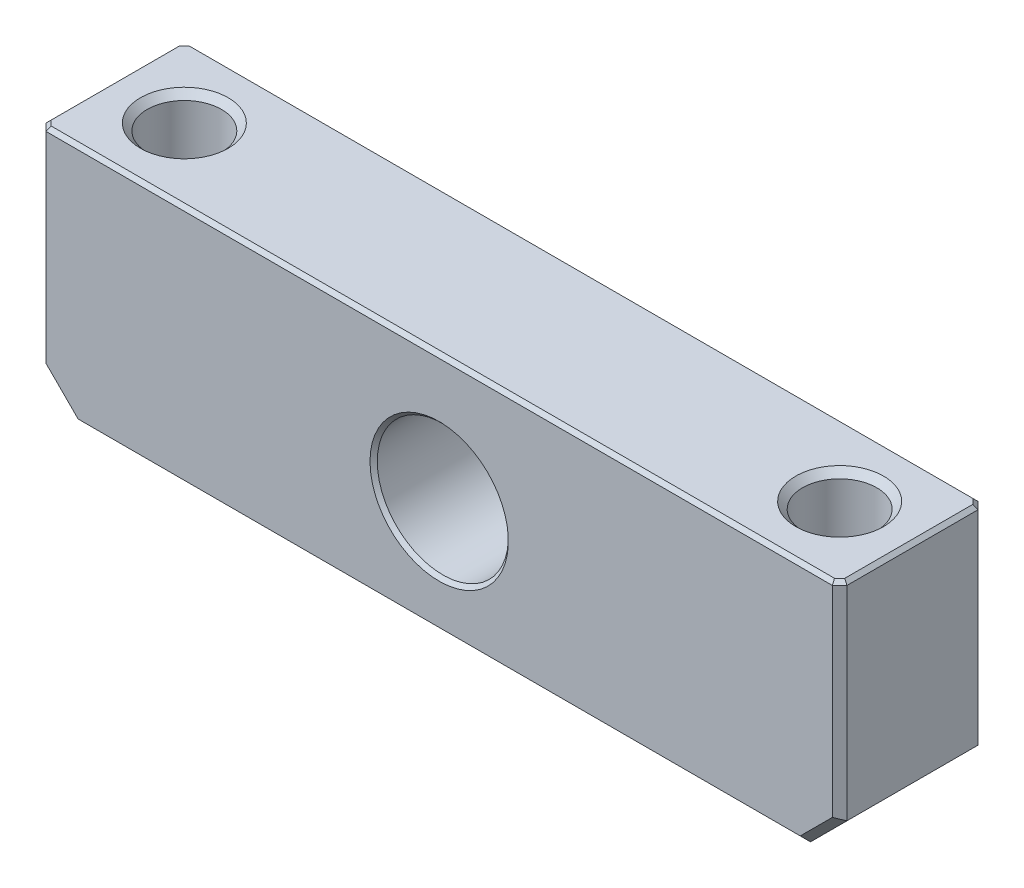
ISO-10303-21;
HEADER;
FILE_DESCRIPTION(('STEP AP214'),'2;1');
FILE_NAME('part.step','',(''),(''),'','','');
FILE_SCHEMA(('AUTOMOTIVE_DESIGN { 1 0 10303 214 1 1 1 1 }'));
ENDSEC;
DATA;
#1=APPLICATION_CONTEXT('core data for automotive mechanical design processes');
#2=APPLICATION_PROTOCOL_DEFINITION('international standard','automotive_design',2000,#1);
#3=PRODUCT_CONTEXT('',#1,'mechanical');
#4=PRODUCT('Part','Part','',(#3));
#5=PRODUCT_RELATED_PRODUCT_CATEGORY('part','',(#4));
#6=PRODUCT_DEFINITION_FORMATION('','',#4);
#7=PRODUCT_DEFINITION_CONTEXT('part definition',#1,'design');
#8=PRODUCT_DEFINITION('design','',#6,#7);
#9=PRODUCT_DEFINITION_SHAPE('','',#8);
#10=(LENGTH_UNIT() NAMED_UNIT(*) SI_UNIT(.MILLI.,.METRE.));
#11=(NAMED_UNIT(*) PLANE_ANGLE_UNIT() SI_UNIT($,.RADIAN.));
#12=(NAMED_UNIT(*) SI_UNIT($,.STERADIAN.) SOLID_ANGLE_UNIT());
#13=UNCERTAINTY_MEASURE_WITH_UNIT(LENGTH_MEASURE(1.E-05),#10,'distance_accuracy_value','');
#14=(GEOMETRIC_REPRESENTATION_CONTEXT(3) GLOBAL_UNCERTAINTY_ASSIGNED_CONTEXT((#13)) GLOBAL_UNIT_ASSIGNED_CONTEXT((#10,
#11,#12)) REPRESENTATION_CONTEXT('',''));
#15=CARTESIAN_POINT('',(0.,0.,0.));
#16=DIRECTION('',(0.,0.,1.));
#17=DIRECTION('',(1.,0.,0.));
#18=AXIS2_PLACEMENT_3D('',#15,#16,#17);
#19=CARTESIAN_POINT('',(-55.,17.5,-10.));
#20=DIRECTION('',(0.,1.,0.));
#21=DIRECTION('',(0.,0.,1.));
#22=AXIS2_PLACEMENT_3D('',#19,#20,#21);
#23=PLANE('',#22);
#24=DIRECTION('',(1.,0.,0.));
#25=VECTOR('',#24,1.);
#26=CARTESIAN_POINT('',(54.,17.5,9.5));
#27=LINE('',#26,#25);
#28=CARTESIAN_POINT('',(-53.7928932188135,17.5,9.5));
#29=VERTEX_POINT('',#28);
#30=CARTESIAN_POINT('',(53.7928932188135,17.5,9.5));
#31=VERTEX_POINT('',#30);
#32=EDGE_CURVE('E275',#29,#31,#27,.T.);
#33=ORIENTED_EDGE('',*,*,#32,.T.);
#34=DIRECTION('',(0.707106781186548,0.,-0.707106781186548));
#35=VECTOR('',#34,1.);
#36=CARTESIAN_POINT('',(9.14644660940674,17.5,54.1464466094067));
#37=LINE('',#36,#35);
#38=CARTESIAN_POINT('',(54.5,17.5,8.79289321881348));
#39=VERTEX_POINT('',#38);
#40=EDGE_CURVE('E289',#31,#39,#37,.T.);
#41=ORIENTED_EDGE('',*,*,#40,.T.);
#42=DIRECTION('',(0.,0.,-1.));
#43=VECTOR('',#42,1.);
#44=CARTESIAN_POINT('',(54.5,17.5,-10.));
#45=LINE('',#44,#43);
#46=CARTESIAN_POINT('',(54.5,17.5,-8.79289321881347));
#47=VERTEX_POINT('',#46);
#48=EDGE_CURVE('E287',#39,#47,#45,.T.);
#49=ORIENTED_EDGE('',*,*,#48,.T.);
#50=DIRECTION('',(-0.707106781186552,0.,-0.707106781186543));
#51=VECTOR('',#50,1.);
#52=CARTESIAN_POINT('',(-0.853553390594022,17.5,-64.1464466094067));
#53=LINE('',#52,#51);
#54=CARTESIAN_POINT('',(53.7928932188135,17.5,-9.5));
#55=VERTEX_POINT('',#54);
#56=EDGE_CURVE('E285',#47,#55,#53,.T.);
#57=ORIENTED_EDGE('',*,*,#56,.T.);
#58=DIRECTION('',(-1.,0.,0.));
#59=VECTOR('',#58,1.);
#60=CARTESIAN_POINT('',(-55.,17.5,-9.5));
#61=LINE('',#60,#59);
#62=CARTESIAN_POINT('',(-53.7928932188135,17.5,-9.5));
#63=VERTEX_POINT('',#62);
#64=EDGE_CURVE('E283',#55,#63,#61,.T.);
#65=ORIENTED_EDGE('',*,*,#64,.T.);
#66=DIRECTION('',(-0.707106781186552,0.,0.707106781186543));
#67=VECTOR('',#66,1.);
#68=CARTESIAN_POINT('',(-54.1464466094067,17.5,-9.14644660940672));
#69=LINE('',#68,#67);
#70=CARTESIAN_POINT('',(-54.5,17.5,-8.79289321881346));
#71=VERTEX_POINT('',#70);
#72=EDGE_CURVE('E281',#63,#71,#69,.T.);
#73=ORIENTED_EDGE('',*,*,#72,.T.);
#74=DIRECTION('',(0.,0.,1.));
#75=VECTOR('',#74,1.);
#76=CARTESIAN_POINT('',(-54.5,17.5,-10.));
#77=LINE('',#76,#75);
#78=CARTESIAN_POINT('',(-54.5,17.5,8.79289321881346));
#79=VERTEX_POINT('',#78);
#80=EDGE_CURVE('E279',#71,#79,#77,.T.);
#81=ORIENTED_EDGE('',*,*,#80,.T.);
#82=DIRECTION('',(0.707106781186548,0.,0.707106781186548));
#83=VECTOR('',#82,1.);
#84=CARTESIAN_POINT('',(-64.1464466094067,17.5,-0.853553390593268));
#85=LINE('',#84,#83);
#86=EDGE_CURVE('E277',#79,#29,#85,.T.);
#87=ORIENTED_EDGE('',*,*,#86,.T.);
#88=EDGE_LOOP('',(#33,#41,#49,#57,#65,#73,#81,#87));
#89=FACE_BOUND('',#88,.T.);
#90=CARTESIAN_POINT('',(-45.,17.5,0.));
#91=DIRECTION('',(0.,1.,0.));
#92=DIRECTION('',(0.,0.,1.));
#93=AXIS2_PLACEMENT_3D('',#90,#91,#92);
#94=CIRCLE('',#93,6.025);
#95=CARTESIAN_POINT('',(-45.,17.5,6.025));
#96=VERTEX_POINT('',#95);
#97=EDGE_CURVE('E171',#96,#96,#94,.T.);
#98=ORIENTED_EDGE('',*,*,#97,.F.);
#99=EDGE_LOOP('',(#98));
#100=FACE_BOUND('',#99,.T.);
#101=CARTESIAN_POINT('',(45.,17.5,0.));
#102=DIRECTION('',(0.,1.,0.));
#103=DIRECTION('',(0.,0.,1.));
#104=AXIS2_PLACEMENT_3D('',#101,#102,#103);
#105=CIRCLE('',#104,6.025);
#106=CARTESIAN_POINT('',(45.,17.5,6.025));
#107=VERTEX_POINT('',#106);
#108=EDGE_CURVE('E164',#107,#107,#105,.T.);
#109=ORIENTED_EDGE('',*,*,#108,.F.);
#110=EDGE_LOOP('',(#109));
#111=FACE_BOUND('',#110,.T.);
#112=ADVANCED_FACE('F36',(#89,#100,#111),#23,.T.);
#113=CARTESIAN_POINT('',(55.,17.5,-10.));
#114=DIRECTION('',(1.,0.,0.));
#115=DIRECTION('',(0.,0.,-1.));
#116=AXIS2_PLACEMENT_3D('',#113,#114,#115);
#117=PLANE('',#116);
#118=DIRECTION('',(0.,1.,0.));
#119=VECTOR('',#118,1.);
#120=CARTESIAN_POINT('',(55.,17.5,-9.00000000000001));
#121=LINE('',#120,#119);
#122=CARTESIAN_POINT('',(55.,-11.,-9.00000000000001));
#123=VERTEX_POINT('',#122);
#124=CARTESIAN_POINT('',(55.,17.,-9.00000000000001));
#125=VERTEX_POINT('',#124);
#126=EDGE_CURVE('E203',#123,#125,#121,.T.);
#127=ORIENTED_EDGE('',*,*,#126,.T.);
#128=DIRECTION('',(0.,0.,1.));
#129=VECTOR('',#128,1.);
#130=CARTESIAN_POINT('',(55.,17.,-10.));
#131=LINE('',#130,#129);
#132=CARTESIAN_POINT('',(55.,17.,9.00000000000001));
#133=VERTEX_POINT('',#132);
#134=EDGE_CURVE('E295',#125,#133,#131,.T.);
#135=ORIENTED_EDGE('',*,*,#134,.T.);
#136=DIRECTION('',(0.,-1.,0.));
#137=VECTOR('',#136,1.);
#138=CARTESIAN_POINT('',(55.,-11.,9.00000000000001));
#139=LINE('',#138,#137);
#140=CARTESIAN_POINT('',(55.,-11.,9.00000000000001));
#141=VERTEX_POINT('',#140);
#142=EDGE_CURVE('E206',#133,#141,#139,.T.);
#143=ORIENTED_EDGE('',*,*,#142,.T.);
#144=DIRECTION('',(0.,0.,-1.));
#145=VECTOR('',#144,1.);
#146=CARTESIAN_POINT('',(55.,-11.,-10.));
#147=LINE('',#146,#145);
#148=EDGE_CURVE('E189',#141,#123,#147,.T.);
#149=ORIENTED_EDGE('',*,*,#148,.T.);
#150=EDGE_LOOP('',(#127,#135,#143,#149));
#151=FACE_BOUND('',#150,.T.);
#152=ADVANCED_FACE('F395',(#151),#117,.T.);
#153=CARTESIAN_POINT('',(-55.,-16.,-10.));
#154=DIRECTION('',(0.,-1.,0.));
#155=DIRECTION('',(0.,0.,-1.));
#156=AXIS2_PLACEMENT_3D('',#153,#154,#155);
#157=PLANE('',#156);
#158=DIRECTION('',(0.,0.,1.));
#159=VECTOR('',#158,1.);
#160=CARTESIAN_POINT('',(50.,-16.,-10.));
#161=LINE('',#160,#159);
#162=CARTESIAN_POINT('',(50.,-16.,-9.00000000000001));
#163=VERTEX_POINT('',#162);
#164=CARTESIAN_POINT('',(50.,-16.,9.00000000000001));
#165=VERTEX_POINT('',#164);
#166=EDGE_CURVE('E183',#163,#165,#161,.T.);
#167=ORIENTED_EDGE('',*,*,#166,.T.);
#168=DIRECTION('',(-1.,0.,0.));
#169=VECTOR('',#168,1.);
#170=CARTESIAN_POINT('',(-50.,-16.,9.00000000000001));
#171=LINE('',#170,#169);
#172=CARTESIAN_POINT('',(-50.,-16.,9.00000000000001));
#173=VERTEX_POINT('',#172);
#174=EDGE_CURVE('E214',#165,#173,#171,.T.);
#175=ORIENTED_EDGE('',*,*,#174,.T.);
#176=DIRECTION('',(0.,0.,-1.));
#177=VECTOR('',#176,1.);
#178=CARTESIAN_POINT('',(-50.,-16.,-10.));
#179=LINE('',#178,#177);
#180=CARTESIAN_POINT('',(-50.,-16.,-9.00000000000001));
#181=VERTEX_POINT('',#180);
#182=EDGE_CURVE('E186',#173,#181,#179,.T.);
#183=ORIENTED_EDGE('',*,*,#182,.T.);
#184=DIRECTION('',(1.,0.,0.));
#185=VECTOR('',#184,1.);
#186=CARTESIAN_POINT('',(-55.,-16.,-9.00000000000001));
#187=LINE('',#186,#185);
#188=EDGE_CURVE('E212',#181,#163,#187,.T.);
#189=ORIENTED_EDGE('',*,*,#188,.T.);
#190=EDGE_LOOP('',(#167,#175,#183,#189));
#191=FACE_BOUND('',#190,.T.);
#192=ADVANCED_FACE('F352',(#191),#157,.T.);
#193=CARTESIAN_POINT('',(-55.,-16.,-10.));
#194=DIRECTION('',(-1.,0.,0.));
#195=DIRECTION('',(0.,0.,1.));
#196=AXIS2_PLACEMENT_3D('',#193,#194,#195);
#197=PLANE('',#196);
#198=DIRECTION('',(0.,1.,0.));
#199=VECTOR('',#198,1.);
#200=CARTESIAN_POINT('',(-55.,17.5,9.00000000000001));
#201=LINE('',#200,#199);
#202=CARTESIAN_POINT('',(-55.,-11.,9.00000000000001));
#203=VERTEX_POINT('',#202);
#204=CARTESIAN_POINT('',(-55.,17.,9.00000000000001));
#205=VERTEX_POINT('',#204);
#206=EDGE_CURVE('E222',#203,#205,#201,.T.);
#207=ORIENTED_EDGE('',*,*,#206,.T.);
#208=DIRECTION('',(0.,0.,-1.));
#209=VECTOR('',#208,1.);
#210=CARTESIAN_POINT('',(-55.,17.,-10.));
#211=LINE('',#210,#209);
#212=CARTESIAN_POINT('',(-55.,17.,-9.00000000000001));
#213=VERTEX_POINT('',#212);
#214=EDGE_CURVE('E45',#205,#213,#211,.T.);
#215=ORIENTED_EDGE('',*,*,#214,.T.);
#216=DIRECTION('',(0.,-1.,0.));
#217=VECTOR('',#216,1.);
#218=CARTESIAN_POINT('',(-55.,-16.,-9.00000000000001));
#219=LINE('',#218,#217);
#220=CARTESIAN_POINT('',(-55.,-11.,-9.00000000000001));
#221=VERTEX_POINT('',#220);
#222=EDGE_CURVE('E220',#213,#221,#219,.T.);
#223=ORIENTED_EDGE('',*,*,#222,.T.);
#224=DIRECTION('',(0.,0.,1.));
#225=VECTOR('',#224,1.);
#226=CARTESIAN_POINT('',(-55.,-11.,-10.));
#227=LINE('',#226,#225);
#228=EDGE_CURVE('E180',#221,#203,#227,.T.);
#229=ORIENTED_EDGE('',*,*,#228,.T.);
#230=EDGE_LOOP('',(#207,#215,#223,#229));
#231=FACE_BOUND('',#230,.T.);
#232=ADVANCED_FACE('F385',(#231),#197,.T.);
#233=CARTESIAN_POINT('',(55.,17.5,-10.));
#234=DIRECTION('',(0.,0.,-1.));
#235=DIRECTION('',(-1.,0.,0.));
#236=AXIS2_PLACEMENT_3D('',#233,#234,#235);
#237=PLANE('',#236);
#238=CARTESIAN_POINT('',(0.,0.,-10.));
#239=DIRECTION('',(0.,0.,-1.));
#240=DIRECTION('',(-1.,0.,0.));
#241=AXIS2_PLACEMENT_3D('',#238,#239,#240);
#242=CIRCLE('',#241,9.49999999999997);
#243=CARTESIAN_POINT('',(-9.49999999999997,0.,-10.));
#244=VERTEX_POINT('',#243);
#245=EDGE_CURVE('E272',#244,#244,#242,.F.);
#246=ORIENTED_EDGE('',*,*,#245,.T.);
#247=EDGE_LOOP('',(#246));
#248=FACE_BOUND('',#247,.T.);
#249=DIRECTION('',(0.,1.,0.));
#250=VECTOR('',#249,1.);
#251=CARTESIAN_POINT('',(-54.,17.5,-10.));
#252=LINE('',#251,#250);
#253=CARTESIAN_POINT('',(-54.,-10.5857864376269,-10.));
#254=VERTEX_POINT('',#253);
#255=CARTESIAN_POINT('',(-54.,17.,-10.));
#256=VERTEX_POINT('',#255);
#257=EDGE_CURVE('E224',#254,#256,#252,.T.);
#258=ORIENTED_EDGE('',*,*,#257,.T.);
#259=DIRECTION('',(1.,0.,0.));
#260=VECTOR('',#259,1.);
#261=CARTESIAN_POINT('',(55.,17.,-10.));
#262=LINE('',#261,#260);
#263=CARTESIAN_POINT('',(54.,17.,-10.));
#264=VERTEX_POINT('',#263);
#265=EDGE_CURVE('E270',#256,#264,#262,.T.);
#266=ORIENTED_EDGE('',*,*,#265,.T.);
#267=DIRECTION('',(0.,-1.,0.));
#268=VECTOR('',#267,1.);
#269=CARTESIAN_POINT('',(54.,17.5,-10.));
#270=LINE('',#269,#268);
#271=CARTESIAN_POINT('',(54.,-10.5857864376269,-10.));
#272=VERTEX_POINT('',#271);
#273=EDGE_CURVE('E233',#264,#272,#270,.T.);
#274=ORIENTED_EDGE('',*,*,#273,.T.);
#275=DIRECTION('',(-0.707106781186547,-0.707106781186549,0.));
#276=VECTOR('',#275,1.);
#277=CARTESIAN_POINT('',(68.5428932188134,3.95710678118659,-10.));
#278=LINE('',#277,#276);
#279=CARTESIAN_POINT('',(49.5857864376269,-15.,-10.));
#280=VERTEX_POINT('',#279);
#281=EDGE_CURVE('E231',#272,#280,#278,.T.);
#282=ORIENTED_EDGE('',*,*,#281,.T.);
#283=DIRECTION('',(-1.,0.,0.));
#284=VECTOR('',#283,1.);
#285=CARTESIAN_POINT('',(55.,-15.,-10.));
#286=LINE('',#285,#284);
#287=CARTESIAN_POINT('',(-49.5857864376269,-15.,-10.));
#288=VERTEX_POINT('',#287);
#289=EDGE_CURVE('E229',#280,#288,#286,.T.);
#290=ORIENTED_EDGE('',*,*,#289,.T.);
#291=DIRECTION('',(-0.707106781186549,0.707106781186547,0.));
#292=VECTOR('',#291,1.);
#293=CARTESIAN_POINT('',(-13.5428932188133,-51.0428932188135,-10.));
#294=LINE('',#293,#292);
#295=EDGE_CURVE('E227',#288,#254,#294,.T.);
#296=ORIENTED_EDGE('',*,*,#295,.T.);
#297=EDGE_LOOP('',(#258,#266,#274,#282,#290,#296));
#298=FACE_BOUND('',#297,.T.);
#299=ADVANCED_FACE('F337',(#248,#298),#237,.T.);
#300=CARTESIAN_POINT('',(0.,0.,-10.));
#301=DIRECTION('',(0.,0.,1.));
#302=DIRECTION('',(1.,0.,0.));
#303=AXIS2_PLACEMENT_3D('',#300,#301,#302);
#304=CYLINDRICAL_SURFACE('',#303,9.);
#305=CARTESIAN_POINT('',(0.,0.,9.50000000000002));
#306=DIRECTION('',(0.,0.,-1.));
#307=DIRECTION('',(-1.,0.,0.));
#308=AXIS2_PLACEMENT_3D('',#305,#306,#307);
#309=CIRCLE('',#308,9.);
#310=CARTESIAN_POINT('',(-9.,0.,9.50000000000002));
#311=VERTEX_POINT('',#310);
#312=EDGE_CURVE('E262',#311,#311,#309,.F.);
#313=ORIENTED_EDGE('',*,*,#312,.T.);
#314=EDGE_LOOP('',(#313));
#315=FACE_BOUND('',#314,.T.);
#316=CARTESIAN_POINT('',(0.,0.,-9.50000000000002));
#317=DIRECTION('',(0.,0.,-1.));
#318=DIRECTION('',(-1.,0.,0.));
#319=AXIS2_PLACEMENT_3D('',#316,#317,#318);
#320=CIRCLE('',#319,9.);
#321=CARTESIAN_POINT('',(-9.,0.,-9.50000000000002));
#322=VERTEX_POINT('',#321);
#323=EDGE_CURVE('E235',#322,#322,#320,.T.);
#324=ORIENTED_EDGE('',*,*,#323,.T.);
#325=EDGE_LOOP('',(#324));
#326=FACE_BOUND('',#325,.T.);
#327=ADVANCED_FACE('F392',(#315,#326),#304,.F.);
#328=CARTESIAN_POINT('',(55.,17.5,10.));
#329=DIRECTION('',(0.,0.,-1.));
#330=DIRECTION('',(-1.,0.,0.));
#331=AXIS2_PLACEMENT_3D('',#328,#329,#330);
#332=PLANE('',#331);
#333=CARTESIAN_POINT('',(0.,0.,10.));
#334=DIRECTION('',(0.,0.,-1.));
#335=DIRECTION('',(-1.,0.,0.));
#336=AXIS2_PLACEMENT_3D('',#333,#334,#335);
#337=CIRCLE('',#336,9.49999999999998);
#338=CARTESIAN_POINT('',(-9.49999999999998,0.,10.));
#339=VERTEX_POINT('',#338);
#340=EDGE_CURVE('E267',#339,#339,#337,.T.);
#341=ORIENTED_EDGE('',*,*,#340,.T.);
#342=EDGE_LOOP('',(#341));
#343=FACE_BOUND('',#342,.T.);
#344=DIRECTION('',(0.,1.,0.));
#345=VECTOR('',#344,1.);
#346=CARTESIAN_POINT('',(54.,17.5,10.));
#347=LINE('',#346,#345);
#348=CARTESIAN_POINT('',(54.,-10.5857864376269,10.));
#349=VERTEX_POINT('',#348);
#350=CARTESIAN_POINT('',(54.,17.,10.));
#351=VERTEX_POINT('',#350);
#352=EDGE_CURVE('E200',#349,#351,#347,.T.);
#353=ORIENTED_EDGE('',*,*,#352,.T.);
#354=DIRECTION('',(-1.,0.,0.));
#355=VECTOR('',#354,1.);
#356=CARTESIAN_POINT('',(-54.,17.,10.));
#357=LINE('',#356,#355);
#358=CARTESIAN_POINT('',(-54.,17.,10.));
#359=VERTEX_POINT('',#358);
#360=EDGE_CURVE('E265',#351,#359,#357,.T.);
#361=ORIENTED_EDGE('',*,*,#360,.T.);
#362=DIRECTION('',(0.,-1.,0.));
#363=VECTOR('',#362,1.);
#364=CARTESIAN_POINT('',(-54.,-11.,10.));
#365=LINE('',#364,#363);
#366=CARTESIAN_POINT('',(-54.,-10.5857864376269,10.));
#367=VERTEX_POINT('',#366);
#368=EDGE_CURVE('E192',#359,#367,#365,.T.);
#369=ORIENTED_EDGE('',*,*,#368,.T.);
#370=DIRECTION('',(0.707106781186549,-0.707106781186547,0.));
#371=VECTOR('',#370,1.);
#372=CARTESIAN_POINT('',(-49.2928932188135,-15.2928932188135,10.));
#373=LINE('',#372,#371);
#374=CARTESIAN_POINT('',(-49.5857864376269,-15.,10.));
#375=VERTEX_POINT('',#374);
#376=EDGE_CURVE('E194',#367,#375,#373,.T.);
#377=ORIENTED_EDGE('',*,*,#376,.T.);
#378=DIRECTION('',(1.,0.,0.));
#379=VECTOR('',#378,1.);
#380=CARTESIAN_POINT('',(50.,-15.,10.));
#381=LINE('',#380,#379);
#382=CARTESIAN_POINT('',(49.5857864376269,-15.,10.));
#383=VERTEX_POINT('',#382);
#384=EDGE_CURVE('E196',#375,#383,#381,.T.);
#385=ORIENTED_EDGE('',*,*,#384,.T.);
#386=DIRECTION('',(0.707106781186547,0.707106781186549,0.));
#387=VECTOR('',#386,1.);
#388=CARTESIAN_POINT('',(54.2928932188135,-10.2928932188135,10.));
#389=LINE('',#388,#387);
#390=EDGE_CURVE('E198',#383,#349,#389,.T.);
#391=ORIENTED_EDGE('',*,*,#390,.T.);
#392=EDGE_LOOP('',(#353,#361,#369,#377,#385,#391));
#393=FACE_BOUND('',#392,.T.);
#394=ADVANCED_FACE('F370',(#343,#393),#332,.F.);
#395=CARTESIAN_POINT('',(45.,-9.5,0.));
#396=DIRECTION('',(0.,1.,0.));
#397=DIRECTION('',(0.,0.,1.));
#398=AXIS2_PLACEMENT_3D('',#395,#396,#397);
#399=CONICAL_SURFACE('',#398,5.09999999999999,1.02974425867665);
#400=CARTESIAN_POINT('',(45.,-12.5643891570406,0.));
#401=VERTEX_POINT('',#400);
#402=VERTEX_LOOP('',#401);
#403=FACE_BOUND('',#402,.T.);
#404=CARTESIAN_POINT('',(45.,-9.5,0.));
#405=DIRECTION('',(0.,1.,0.));
#406=DIRECTION('',(0.,0.,1.));
#407=AXIS2_PLACEMENT_3D('',#404,#405,#406);
#408=CIRCLE('',#407,5.09999999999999);
#409=CARTESIAN_POINT('',(45.,-9.5,5.09999999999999));
#410=VERTEX_POINT('',#409);
#411=EDGE_CURVE('E177',#410,#410,#408,.T.);
#412=ORIENTED_EDGE('',*,*,#411,.T.);
#413=EDGE_LOOP('',(#412));
#414=FACE_BOUND('',#413,.T.);
#415=ADVANCED_FACE('F563',(#403,#414),#399,.F.);
#416=CARTESIAN_POINT('',(45.,17.5,0.));
#417=DIRECTION('',(0.,1.,0.));
#418=DIRECTION('',(0.,0.,1.));
#419=AXIS2_PLACEMENT_3D('',#416,#417,#418);
#420=CYLINDRICAL_SURFACE('',#419,5.09999999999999);
#421=ORIENTED_EDGE('',*,*,#411,.F.);
#422=EDGE_LOOP('',(#421));
#423=FACE_BOUND('',#422,.T.);
#424=CARTESIAN_POINT('',(45.,16.575,0.));
#425=DIRECTION('',(0.,1.,0.));
#426=DIRECTION('',(0.,0.,1.));
#427=AXIS2_PLACEMENT_3D('',#424,#425,#426);
#428=CIRCLE('',#427,5.09999999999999);
#429=CARTESIAN_POINT('',(45.,16.575,5.09999999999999));
#430=VERTEX_POINT('',#429);
#431=EDGE_CURVE('E168',#430,#430,#428,.T.);
#432=ORIENTED_EDGE('',*,*,#431,.T.);
#433=EDGE_LOOP('',(#432));
#434=FACE_BOUND('',#433,.T.);
#435=ADVANCED_FACE('F555',(#423,#434),#420,.F.);
#436=CARTESIAN_POINT('',(45.,17.5,0.));
#437=DIRECTION('',(0.,1.,0.));
#438=DIRECTION('',(0.,0.,1.));
#439=AXIS2_PLACEMENT_3D('',#436,#437,#438);
#440=CONICAL_SURFACE('',#439,6.025,0.785398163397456);
#441=ORIENTED_EDGE('',*,*,#431,.F.);
#442=EDGE_LOOP('',(#441));
#443=FACE_BOUND('',#442,.T.);
#444=ORIENTED_EDGE('',*,*,#108,.T.);
#445=EDGE_LOOP('',(#444));
#446=FACE_BOUND('',#445,.T.);
#447=ADVANCED_FACE('F158',(#443,#446),#440,.F.);
#448=CARTESIAN_POINT('',(-45.,-9.5,0.));
#449=DIRECTION('',(0.,1.,0.));
#450=DIRECTION('',(0.,0.,1.));
#451=AXIS2_PLACEMENT_3D('',#448,#449,#450);
#452=CONICAL_SURFACE('',#451,5.09999999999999,1.02974425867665);
#453=CARTESIAN_POINT('',(-45.,-12.5643891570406,0.));
#454=VERTEX_POINT('',#453);
#455=VERTEX_LOOP('',#454);
#456=FACE_BOUND('',#455,.T.);
#457=CARTESIAN_POINT('',(-45.,-9.5,0.));
#458=DIRECTION('',(0.,1.,0.));
#459=DIRECTION('',(0.,0.,1.));
#460=AXIS2_PLACEMENT_3D('',#457,#458,#459);
#461=CIRCLE('',#460,5.09999999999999);
#462=CARTESIAN_POINT('',(-45.,-9.5,5.09999999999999));
#463=VERTEX_POINT('',#462);
#464=EDGE_CURVE('E162',#463,#463,#461,.T.);
#465=ORIENTED_EDGE('',*,*,#464,.T.);
#466=EDGE_LOOP('',(#465));
#467=FACE_BOUND('',#466,.T.);
#468=ADVANCED_FACE('F154',(#456,#467),#452,.F.);
#469=CARTESIAN_POINT('',(-45.,17.5,0.));
#470=DIRECTION('',(0.,1.,0.));
#471=DIRECTION('',(0.,0.,1.));
#472=AXIS2_PLACEMENT_3D('',#469,#470,#471);
#473=CYLINDRICAL_SURFACE('',#472,5.09999999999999);
#474=ORIENTED_EDGE('',*,*,#464,.F.);
#475=EDGE_LOOP('',(#474));
#476=FACE_BOUND('',#475,.T.);
#477=CARTESIAN_POINT('',(-45.,16.575,0.));
#478=DIRECTION('',(0.,1.,0.));
#479=DIRECTION('',(0.,0.,1.));
#480=AXIS2_PLACEMENT_3D('',#477,#478,#479);
#481=CIRCLE('',#480,5.09999999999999);
#482=CARTESIAN_POINT('',(-45.,16.575,5.09999999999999));
#483=VERTEX_POINT('',#482);
#484=EDGE_CURVE('E165',#483,#483,#481,.T.);
#485=ORIENTED_EDGE('',*,*,#484,.T.);
#486=EDGE_LOOP('',(#485));
#487=FACE_BOUND('',#486,.T.);
#488=ADVANCED_FACE('F157',(#476,#487),#473,.F.);
#489=CARTESIAN_POINT('',(-45.,17.5,0.));
#490=DIRECTION('',(0.,1.,0.));
#491=DIRECTION('',(0.,0.,1.));
#492=AXIS2_PLACEMENT_3D('',#489,#490,#491);
#493=CONICAL_SURFACE('',#492,6.025,0.785398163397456);
#494=ORIENTED_EDGE('',*,*,#484,.F.);
#495=EDGE_LOOP('',(#494));
#496=FACE_BOUND('',#495,.T.);
#497=ORIENTED_EDGE('',*,*,#97,.T.);
#498=EDGE_LOOP('',(#497));
#499=FACE_BOUND('',#498,.T.);
#500=ADVANCED_FACE('F409',(#496,#499),#493,.F.);
#501=CARTESIAN_POINT('',(-55.,-11.,-10.));
#502=DIRECTION('',(0.707106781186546,0.707106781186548,0.));
#503=DIRECTION('',(-0.707106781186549,0.707106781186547,0.));
#504=AXIS2_PLACEMENT_3D('',#501,#502,#503);
#505=PLANE('',#504);
#506=ORIENTED_EDGE('',*,*,#182,.F.);
#507=DIRECTION('',(0.707106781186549,-0.707106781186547,0.));
#508=VECTOR('',#507,1.);
#509=CARTESIAN_POINT('',(-55.,-11.,9.00000000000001));
#510=LINE('',#509,#508);
#511=EDGE_CURVE('E218',#173,#203,#510,.F.);
#512=ORIENTED_EDGE('',*,*,#511,.T.);
#513=ORIENTED_EDGE('',*,*,#228,.F.);
#514=DIRECTION('',(-0.707106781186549,0.707106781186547,0.));
#515=VECTOR('',#514,1.);
#516=CARTESIAN_POINT('',(-55.,-11.,-9.00000000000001));
#517=LINE('',#516,#515);
#518=EDGE_CURVE('E216',#221,#181,#517,.F.);
#519=ORIENTED_EDGE('',*,*,#518,.T.);
#520=EDGE_LOOP('',(#506,#512,#513,#519));
#521=FACE_BOUND('',#520,.T.);
#522=ADVANCED_FACE('F379',(#521),#505,.F.);
#523=CARTESIAN_POINT('',(50.,-16.,-10.));
#524=DIRECTION('',(-0.707106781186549,0.707106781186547,0.));
#525=DIRECTION('',(-0.707106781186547,-0.707106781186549,0.));
#526=AXIS2_PLACEMENT_3D('',#523,#524,#525);
#527=PLANE('',#526);
#528=ORIENTED_EDGE('',*,*,#148,.F.);
#529=DIRECTION('',(0.707106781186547,0.707106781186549,0.));
#530=VECTOR('',#529,1.);
#531=CARTESIAN_POINT('',(50.,-16.,9.00000000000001));
#532=LINE('',#531,#530);
#533=EDGE_CURVE('E210',#141,#165,#532,.F.);
#534=ORIENTED_EDGE('',*,*,#533,.T.);
#535=ORIENTED_EDGE('',*,*,#166,.F.);
#536=DIRECTION('',(-0.707106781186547,-0.707106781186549,0.));
#537=VECTOR('',#536,1.);
#538=CARTESIAN_POINT('',(50.,-16.,-9.00000000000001));
#539=LINE('',#538,#537);
#540=EDGE_CURVE('E208',#163,#123,#539,.F.);
#541=ORIENTED_EDGE('',*,*,#540,.T.);
#542=EDGE_LOOP('',(#528,#534,#535,#541));
#543=FACE_BOUND('',#542,.T.);
#544=ADVANCED_FACE('F357',(#543),#527,.F.);
#545=CARTESIAN_POINT('',(-54.,17.5,10.));
#546=DIRECTION('',(-0.707106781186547,0.,0.707106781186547));
#547=DIRECTION('',(0.707106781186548,0.,0.707106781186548));
#548=AXIS2_PLACEMENT_3D('',#545,#546,#547);
#549=PLANE('',#548);
#550=ORIENTED_EDGE('',*,*,#368,.F.);
#551=DIRECTION('',(-0.707106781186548,0.,-0.707106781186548));
#552=VECTOR('',#551,1.);
#553=CARTESIAN_POINT('',(-54.,17.,10.));
#554=LINE('',#553,#552);
#555=EDGE_CURVE('E11',#359,#205,#554,.T.);
#556=ORIENTED_EDGE('',*,*,#555,.T.);
#557=ORIENTED_EDGE('',*,*,#206,.F.);
#558=DIRECTION('',(-0.678598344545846,-0.281084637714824,-0.678598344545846));
#559=VECTOR('',#558,1.);
#560=CARTESIAN_POINT('',(-48.6428168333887,-8.3667685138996,15.3571831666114));
#561=LINE('',#560,#559);
#562=EDGE_CURVE('E246',#367,#203,#561,.T.);
#563=ORIENTED_EDGE('',*,*,#562,.F.);
#564=EDGE_LOOP('',(#550,#556,#557,#563));
#565=FACE_BOUND('',#564,.T.);
#566=ADVANCED_FACE('F384',(#565),#549,.T.);
#567=CARTESIAN_POINT('',(-13.5428932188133,-51.0428932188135,10.));
#568=DIRECTION('',(0.499999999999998,0.5,-0.707106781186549));
#569=DIRECTION('',(0.,0.816496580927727,0.577350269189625));
#570=AXIS2_PLACEMENT_3D('',#567,#568,#569);
#571=PLANE('',#570);
#572=ORIENTED_EDGE('',*,*,#562,.T.);
#573=ORIENTED_EDGE('',*,*,#511,.F.);
#574=DIRECTION('',(-0.281084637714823,-0.678598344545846,-0.678598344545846));
#575=VECTOR('',#574,1.);
#576=CARTESIAN_POINT('',(-53.613038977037,-24.7226476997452,0.277352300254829));
#577=LINE('',#576,#575);
#578=EDGE_CURVE('E243',#375,#173,#577,.T.);
#579=ORIENTED_EDGE('',*,*,#578,.F.);
#580=ORIENTED_EDGE('',*,*,#376,.F.);
#581=EDGE_LOOP('',(#572,#573,#579,#580));
#582=FACE_BOUND('',#581,.T.);
#583=ADVANCED_FACE('F382',(#582),#571,.F.);
#584=CARTESIAN_POINT('',(55.,-15.,10.));
#585=DIRECTION('',(0.,-0.707106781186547,0.707106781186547));
#586=DIRECTION('',(0.,-0.707106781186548,-0.707106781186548));
#587=AXIS2_PLACEMENT_3D('',#584,#585,#586);
#588=PLANE('',#587);
#589=ORIENTED_EDGE('',*,*,#578,.T.);
#590=ORIENTED_EDGE('',*,*,#174,.F.);
#591=DIRECTION('',(0.281084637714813,-0.678598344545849,-0.678598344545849));
#592=VECTOR('',#591,1.);
#593=CARTESIAN_POINT('',(50.0135557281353,-16.032726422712,8.96727357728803));
#594=LINE('',#593,#592);
#595=EDGE_CURVE('E239',#383,#165,#594,.T.);
#596=ORIENTED_EDGE('',*,*,#595,.F.);
#597=ORIENTED_EDGE('',*,*,#384,.F.);
#598=EDGE_LOOP('',(#589,#590,#596,#597));
#599=FACE_BOUND('',#598,.T.);
#600=ADVANCED_FACE('F376',(#599),#588,.T.);
#601=CARTESIAN_POINT('',(68.5428932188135,3.95710678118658,10.));
#602=DIRECTION('',(-0.500000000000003,0.500000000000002,-0.707106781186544));
#603=DIRECTION('',(-0.816496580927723,0.,0.57735026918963));
#604=AXIS2_PLACEMENT_3D('',#601,#602,#603);
#605=PLANE('',#604);
#606=ORIENTED_EDGE('',*,*,#595,.T.);
#607=ORIENTED_EDGE('',*,*,#533,.F.);
#608=DIRECTION('',(0.678598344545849,-0.281084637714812,-0.678598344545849));
#609=VECTOR('',#608,1.);
#610=CARTESIAN_POINT('',(57.9229766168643,-12.2107365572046,6.07702338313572));
#611=LINE('',#610,#609);
#612=EDGE_CURVE('E236',#349,#141,#611,.T.);
#613=ORIENTED_EDGE('',*,*,#612,.F.);
#614=ORIENTED_EDGE('',*,*,#390,.F.);
#615=EDGE_LOOP('',(#606,#607,#613,#614));
#616=FACE_BOUND('',#615,.T.);
#617=ADVANCED_FACE('F361',(#616),#605,.F.);
#618=CARTESIAN_POINT('',(54.,17.5,10.));
#619=DIRECTION('',(0.707106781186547,0.,0.707106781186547));
#620=DIRECTION('',(0.707106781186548,0.,-0.707106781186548));
#621=AXIS2_PLACEMENT_3D('',#618,#619,#620);
#622=PLANE('',#621);
#623=ORIENTED_EDGE('',*,*,#142,.F.);
#624=DIRECTION('',(-0.707106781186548,0.,0.707106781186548));
#625=VECTOR('',#624,1.);
#626=CARTESIAN_POINT('',(54.,17.,10.));
#627=LINE('',#626,#625);
#628=EDGE_CURVE('E292',#133,#351,#627,.T.);
#629=ORIENTED_EDGE('',*,*,#628,.T.);
#630=ORIENTED_EDGE('',*,*,#352,.F.);
#631=ORIENTED_EDGE('',*,*,#612,.T.);
#632=EDGE_LOOP('',(#623,#629,#630,#631));
#633=FACE_BOUND('',#632,.T.);
#634=ADVANCED_FACE('F367',(#633),#622,.T.);
#635=CARTESIAN_POINT('',(-55.,-16.,-9.00000000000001));
#636=DIRECTION('',(0.707106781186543,0.,0.707106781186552));
#637=DIRECTION('',(0.707106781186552,0.,-0.707106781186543));
#638=AXIS2_PLACEMENT_3D('',#635,#636,#637);
#639=PLANE('',#638);
#640=ORIENTED_EDGE('',*,*,#222,.F.);
#641=DIRECTION('',(-0.707106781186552,0.,0.707106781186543));
#642=VECTOR('',#641,1.);
#643=CARTESIAN_POINT('',(-55.,17.,-9.00000000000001));
#644=LINE('',#643,#642);
#645=EDGE_CURVE('E299',#213,#256,#644,.F.);
#646=ORIENTED_EDGE('',*,*,#645,.T.);
#647=ORIENTED_EDGE('',*,*,#257,.F.);
#648=DIRECTION('',(0.678598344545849,0.281084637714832,-0.67859834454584));
#649=VECTOR('',#648,1.);
#650=CARTESIAN_POINT('',(-55.9537178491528,-11.3950428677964,-8.04628215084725));
#651=LINE('',#650,#649);
#652=EDGE_CURVE('E240',#221,#254,#651,.T.);
#653=ORIENTED_EDGE('',*,*,#652,.F.);
#654=EDGE_LOOP('',(#640,#646,#647,#653));
#655=FACE_BOUND('',#654,.T.);
#656=ADVANCED_FACE('F334',(#655),#639,.F.);
#657=CARTESIAN_POINT('',(-13.5428932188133,-51.0428932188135,-10.));
#658=DIRECTION('',(-0.499999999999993,-0.499999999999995,-0.707106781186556));
#659=DIRECTION('',(0.,0.816496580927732,-0.577350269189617));
#660=AXIS2_PLACEMENT_3D('',#657,#658,#659);
#661=PLANE('',#660);
#662=ORIENTED_EDGE('',*,*,#652,.T.);
#663=ORIENTED_EDGE('',*,*,#295,.F.);
#664=DIRECTION('',(0.281084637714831,0.678598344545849,-0.67859834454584));
#665=VECTOR('',#664,1.);
#666=CARTESIAN_POINT('',(-53.613038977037,-24.7226476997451,-0.277352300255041));
#667=LINE('',#666,#665);
#668=EDGE_CURVE('E255',#181,#288,#667,.T.);
#669=ORIENTED_EDGE('',*,*,#668,.F.);
#670=ORIENTED_EDGE('',*,*,#518,.F.);
#671=EDGE_LOOP('',(#662,#663,#669,#670));
#672=FACE_BOUND('',#671,.T.);
#673=ADVANCED_FACE('F343',(#672),#661,.T.);
#674=CARTESIAN_POINT('',(-55.,-16.,-9.00000000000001));
#675=DIRECTION('',(0.,0.707106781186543,0.707106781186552));
#676=DIRECTION('',(0.,-0.707106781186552,0.707106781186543));
#677=AXIS2_PLACEMENT_3D('',#674,#675,#676);
#678=PLANE('',#677);
#679=ORIENTED_EDGE('',*,*,#668,.T.);
#680=ORIENTED_EDGE('',*,*,#289,.F.);
#681=DIRECTION('',(-0.28108463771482,0.678598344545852,-0.678598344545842));
#682=VECTOR('',#681,1.);
#683=CARTESIAN_POINT('',(41.7040997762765,4.02807483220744,-29.0280748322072));
#684=LINE('',#683,#682);
#685=EDGE_CURVE('E252',#163,#280,#684,.T.);
#686=ORIENTED_EDGE('',*,*,#685,.F.);
#687=ORIENTED_EDGE('',*,*,#188,.F.);
#688=EDGE_LOOP('',(#679,#680,#686,#687));
#689=FACE_BOUND('',#688,.T.);
#690=ADVANCED_FACE('F347',(#689),#678,.F.);
#691=CARTESIAN_POINT('',(68.5428932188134,3.9571067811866,-10.));
#692=DIRECTION('',(0.499999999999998,-0.499999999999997,-0.707106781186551));
#693=DIRECTION('',(-0.816496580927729,0.,-0.577350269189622));
#694=AXIS2_PLACEMENT_3D('',#691,#692,#693);
#695=PLANE('',#694);
#696=ORIENTED_EDGE('',*,*,#685,.T.);
#697=ORIENTED_EDGE('',*,*,#281,.F.);
#698=DIRECTION('',(-0.678598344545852,0.281084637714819,-0.678598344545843));
#699=VECTOR('',#698,1.);
#700=CARTESIAN_POINT('',(57.9229766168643,-12.2107365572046,-6.07702338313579));
#701=LINE('',#700,#699);
#702=EDGE_CURVE('E249',#123,#272,#701,.T.);
#703=ORIENTED_EDGE('',*,*,#702,.F.);
#704=ORIENTED_EDGE('',*,*,#540,.F.);
#705=EDGE_LOOP('',(#696,#697,#703,#704));
#706=FACE_BOUND('',#705,.T.);
#707=ADVANCED_FACE('F426',(#706),#695,.T.);
#708=CARTESIAN_POINT('',(55.,17.5,-9.00000000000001));
#709=DIRECTION('',(-0.707106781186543,0.,0.707106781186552));
#710=DIRECTION('',(0.707106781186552,0.,0.707106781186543));
#711=AXIS2_PLACEMENT_3D('',#708,#709,#710);
#712=PLANE('',#711);
#713=ORIENTED_EDGE('',*,*,#273,.F.);
#714=DIRECTION('',(-0.707106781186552,0.,-0.707106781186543));
#715=VECTOR('',#714,1.);
#716=CARTESIAN_POINT('',(55.,17.,-9.00000000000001));
#717=LINE('',#716,#715);
#718=EDGE_CURVE('E297',#264,#125,#717,.F.);
#719=ORIENTED_EDGE('',*,*,#718,.T.);
#720=ORIENTED_EDGE('',*,*,#126,.F.);
#721=ORIENTED_EDGE('',*,*,#702,.T.);
#722=EDGE_LOOP('',(#713,#719,#720,#721));
#723=FACE_BOUND('',#722,.T.);
#724=ADVANCED_FACE('F422',(#723),#712,.F.);
#725=CARTESIAN_POINT('',(0.,0.,9.50000000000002));
#726=DIRECTION('',(0.,0.,1.));
#727=DIRECTION('',(1.,0.,0.));
#728=AXIS2_PLACEMENT_3D('',#725,#726,#727);
#729=CONICAL_SURFACE('',#728,9.,0.785398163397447);
#730=ORIENTED_EDGE('',*,*,#340,.F.);
#731=EDGE_LOOP('',(#730));
#732=FACE_BOUND('',#731,.T.);
#733=ORIENTED_EDGE('',*,*,#312,.F.);
#734=EDGE_LOOP('',(#733));
#735=FACE_BOUND('',#734,.T.);
#736=ADVANCED_FACE('F425',(#732,#735),#729,.F.);
#737=CARTESIAN_POINT('',(0.,0.,-10.));
#738=DIRECTION('',(0.,0.,-1.));
#739=DIRECTION('',(-1.,0.,0.));
#740=AXIS2_PLACEMENT_3D('',#737,#738,#739);
#741=CONICAL_SURFACE('',#740,9.49999999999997,0.785398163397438);
#742=ORIENTED_EDGE('',*,*,#323,.F.);
#743=EDGE_LOOP('',(#742));
#744=FACE_BOUND('',#743,.T.);
#745=ORIENTED_EDGE('',*,*,#245,.F.);
#746=EDGE_LOOP('',(#745));
#747=FACE_BOUND('',#746,.T.);
#748=ADVANCED_FACE('F439',(#744,#747),#741,.F.);
#749=CARTESIAN_POINT('',(-54.1464466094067,17.5,-9.14644660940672));
#750=DIRECTION('',(-0.499999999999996,0.707106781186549,-0.500000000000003));
#751=DIRECTION('',(0.,0.577350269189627,0.816496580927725));
#752=AXIS2_PLACEMENT_3D('',#749,#750,#751);
#753=PLANE('',#752);
#754=DIRECTION('',(0.28108463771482,0.678598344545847,0.678598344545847));
#755=VECTOR('',#754,1.);
#756=CARTESIAN_POINT('',(-53.7533889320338,17.5953717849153,-9.40462821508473));
#757=LINE('',#756,#755);
#758=EDGE_CURVE('E317',#256,#63,#757,.T.);
#759=ORIENTED_EDGE('',*,*,#758,.F.);
#760=ORIENTED_EDGE('',*,*,#645,.F.);
#761=DIRECTION('',(0.678598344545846,0.678598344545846,0.281084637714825));
#762=VECTOR('',#761,1.);
#763=CARTESIAN_POINT('',(-54.7302478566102,17.2697521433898,-8.88826500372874));
#764=LINE('',#763,#762);
#765=EDGE_CURVE('E40',#71,#213,#764,.F.);
#766=ORIENTED_EDGE('',*,*,#765,.F.);
#767=ORIENTED_EDGE('',*,*,#72,.F.);
#768=EDGE_LOOP('',(#759,#760,#766,#767));
#769=FACE_BOUND('',#768,.T.);
#770=ADVANCED_FACE('F38',(#769),#753,.T.);
#771=CARTESIAN_POINT('',(-54.5,17.5,-10.));
#772=DIRECTION('',(0.707106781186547,-0.707106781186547,0.));
#773=DIRECTION('',(0.707106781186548,0.707106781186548,0.));
#774=AXIS2_PLACEMENT_3D('',#771,#772,#773);
#775=PLANE('',#774);
#776=ORIENTED_EDGE('',*,*,#765,.T.);
#777=ORIENTED_EDGE('',*,*,#214,.F.);
#778=DIRECTION('',(-0.678598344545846,-0.678598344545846,0.281084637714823));
#779=VECTOR('',#778,1.);
#780=CARTESIAN_POINT('',(-57.1021496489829,14.8978503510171,9.87073889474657));
#781=LINE('',#780,#779);
#782=EDGE_CURVE('E315',#79,#205,#781,.T.);
#783=ORIENTED_EDGE('',*,*,#782,.F.);
#784=ORIENTED_EDGE('',*,*,#80,.F.);
#785=EDGE_LOOP('',(#776,#777,#783,#784));
#786=FACE_BOUND('',#785,.T.);
#787=ADVANCED_FACE('F327',(#786),#775,.F.);
#788=CARTESIAN_POINT('',(-55.,17.5,-9.5));
#789=DIRECTION('',(0.,-0.707106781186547,0.707106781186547));
#790=DIRECTION('',(0.,-0.707106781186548,-0.707106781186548));
#791=AXIS2_PLACEMENT_3D('',#788,#789,#790);
#792=PLANE('',#791);
#793=ORIENTED_EDGE('',*,*,#758,.T.);
#794=ORIENTED_EDGE('',*,*,#64,.F.);
#795=DIRECTION('',(-0.281084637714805,0.67859834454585,0.67859834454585));
#796=VECTOR('',#795,1.);
#797=CARTESIAN_POINT('',(45.1973219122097,38.2515448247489,11.2515448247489));
#798=LINE('',#797,#796);
#799=EDGE_CURVE('E312',#264,#55,#798,.T.);
#800=ORIENTED_EDGE('',*,*,#799,.F.);
#801=ORIENTED_EDGE('',*,*,#265,.F.);
#802=EDGE_LOOP('',(#793,#794,#800,#801));
#803=FACE_BOUND('',#802,.T.);
#804=ADVANCED_FACE('F463',(#803),#792,.F.);
#805=CARTESIAN_POINT('',(-64.1464466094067,17.5,-0.853553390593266));
#806=DIRECTION('',(0.499999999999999,-0.707106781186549,-0.499999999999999));
#807=DIRECTION('',(0.,0.577350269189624,-0.816496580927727));
#808=AXIS2_PLACEMENT_3D('',#805,#806,#807);
#809=PLANE('',#808);
#810=ORIENTED_EDGE('',*,*,#782,.T.);
#811=ORIENTED_EDGE('',*,*,#555,.F.);
#812=DIRECTION('',(0.281084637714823,0.678598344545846,-0.678598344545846));
#813=VECTOR('',#812,1.);
#814=CARTESIAN_POINT('',(-45.3880654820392,37.7910491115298,-10.7910491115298));
#815=LINE('',#814,#813);
#816=EDGE_CURVE('E309',#29,#359,#815,.F.);
#817=ORIENTED_EDGE('',*,*,#816,.F.);
#818=ORIENTED_EDGE('',*,*,#86,.F.);
#819=EDGE_LOOP('',(#810,#811,#817,#818));
#820=FACE_BOUND('',#819,.T.);
#821=ADVANCED_FACE('F459',(#820),#809,.F.);
#822=CARTESIAN_POINT('',(-0.853553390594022,17.5,-64.1464466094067));
#823=DIRECTION('',(0.5,0.707106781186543,-0.500000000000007));
#824=DIRECTION('',(0.,0.577350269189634,0.81649658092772));
#825=AXIS2_PLACEMENT_3D('',#822,#823,#824);
#826=PLANE('',#825);
#827=ORIENTED_EDGE('',*,*,#799,.T.);
#828=ORIENTED_EDGE('',*,*,#56,.F.);
#829=DIRECTION('',(-0.678598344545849,0.678598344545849,0.28108463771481));
#830=VECTOR('',#829,1.);
#831=CARTESIAN_POINT('',(39.5682603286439,32.4317396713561,-2.60796413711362));
#832=LINE('',#831,#830);
#833=EDGE_CURVE('E306',#125,#47,#832,.T.);
#834=ORIENTED_EDGE('',*,*,#833,.F.);
#835=ORIENTED_EDGE('',*,*,#718,.F.);
#836=EDGE_LOOP('',(#827,#828,#834,#835));
#837=FACE_BOUND('',#836,.T.);
#838=ADVANCED_FACE('F455',(#837),#826,.T.);
#839=CARTESIAN_POINT('',(55.,17.,10.));
#840=DIRECTION('',(0.,0.707106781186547,0.707106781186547));
#841=DIRECTION('',(0.,-0.707106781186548,0.707106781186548));
#842=AXIS2_PLACEMENT_3D('',#839,#840,#841);
#843=PLANE('',#842);
#844=ORIENTED_EDGE('',*,*,#816,.T.);
#845=ORIENTED_EDGE('',*,*,#360,.F.);
#846=DIRECTION('',(0.281084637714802,-0.678598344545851,0.678598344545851));
#847=VECTOR('',#846,1.);
#848=CARTESIAN_POINT('',(54.0790085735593,16.8092564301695,10.1907435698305));
#849=LINE('',#848,#847);
#850=EDGE_CURVE('E304',#31,#351,#849,.T.);
#851=ORIENTED_EDGE('',*,*,#850,.F.);
#852=ORIENTED_EDGE('',*,*,#32,.F.);
#853=EDGE_LOOP('',(#844,#845,#851,#852));
#854=FACE_BOUND('',#853,.T.);
#855=ADVANCED_FACE('F451',(#854),#843,.T.);
#856=CARTESIAN_POINT('',(55.,17.,-10.));
#857=DIRECTION('',(-0.707106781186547,-0.707106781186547,0.));
#858=DIRECTION('',(0.707106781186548,-0.707106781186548,0.));
#859=AXIS2_PLACEMENT_3D('',#856,#857,#858);
#860=PLANE('',#859);
#861=ORIENTED_EDGE('',*,*,#833,.T.);
#862=ORIENTED_EDGE('',*,*,#48,.F.);
#863=DIRECTION('',(0.678598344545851,-0.678598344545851,0.281084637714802));
#864=VECTOR('',#863,1.);
#865=CARTESIAN_POINT('',(51.3758721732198,20.6241278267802,7.49883710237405));
#866=LINE('',#865,#864);
#867=EDGE_CURVE('E302',#133,#39,#866,.F.);
#868=ORIENTED_EDGE('',*,*,#867,.F.);
#869=ORIENTED_EDGE('',*,*,#134,.F.);
#870=EDGE_LOOP('',(#861,#862,#868,#869));
#871=FACE_BOUND('',#870,.T.);
#872=ADVANCED_FACE('F447',(#871),#860,.F.);
#873=CARTESIAN_POINT('',(9.14644660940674,17.5,54.1464466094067));
#874=DIRECTION('',(-0.500000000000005,-0.70710678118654,-0.500000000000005));
#875=DIRECTION('',(0.,0.577350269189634,-0.81649658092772));
#876=AXIS2_PLACEMENT_3D('',#873,#874,#875);
#877=PLANE('',#876);
#878=ORIENTED_EDGE('',*,*,#850,.T.);
#879=ORIENTED_EDGE('',*,*,#628,.F.);
#880=ORIENTED_EDGE('',*,*,#867,.T.);
#881=ORIENTED_EDGE('',*,*,#40,.F.);
#882=EDGE_LOOP('',(#878,#879,#880,#881));
#883=FACE_BOUND('',#882,.T.);
#884=ADVANCED_FACE('F444',(#883),#877,.F.);
#885=CLOSED_SHELL('',(#112,#152,#192,#232,#299,#327,#394,#415,#435,#447,#468,#488,#500,#522,
#544,#566,#583,#600,#617,#634,#656,#673,#690,#707,#724,#736,#748,#770,#787,#804,#821,#838,#855,
#872,#884));
#886=MANIFOLD_SOLID_BREP('B2',#885);
#887=ADVANCED_BREP_SHAPE_REPRESENTATION('',(#18,#886),#14);
#888=SHAPE_DEFINITION_REPRESENTATION(#9,#887);
ENDSEC;
END-ISO-10303-21;
